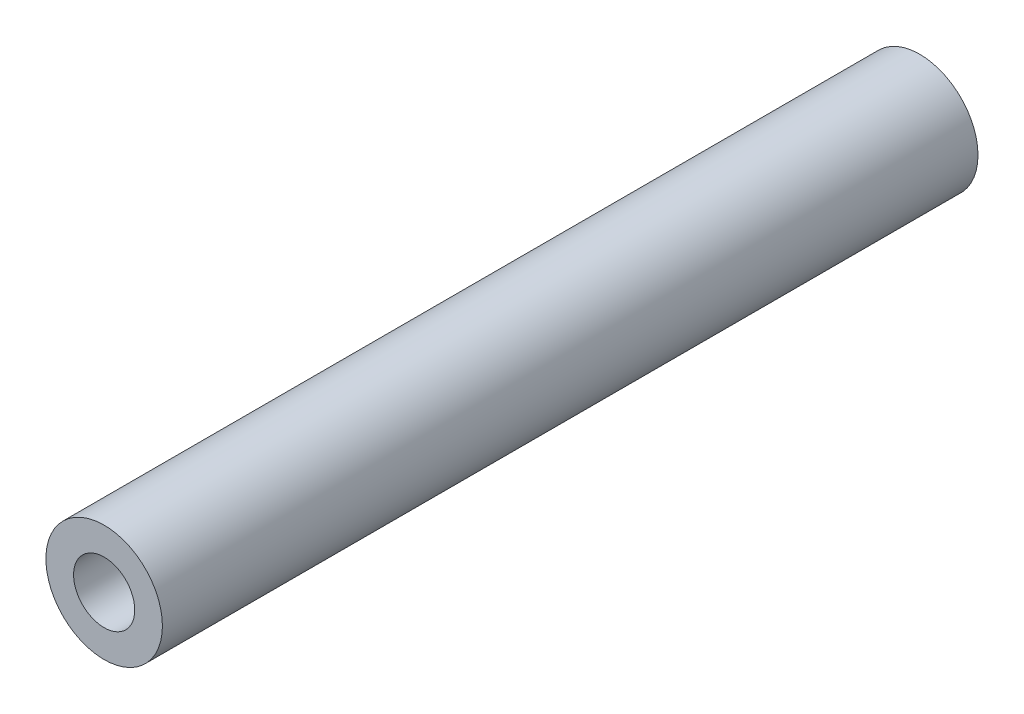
ISO-10303-21;
HEADER;
FILE_DESCRIPTION(('STEP AP214'),'2;1');
FILE_NAME('part.step','',(''),(''),'','','');
FILE_SCHEMA(('AUTOMOTIVE_DESIGN { 1 0 10303 214 1 1 1 1 }'));
ENDSEC;
DATA;
#1=APPLICATION_CONTEXT('core data for automotive mechanical design processes');
#2=APPLICATION_PROTOCOL_DEFINITION('international standard','automotive_design',2000,#1);
#3=PRODUCT_CONTEXT('',#1,'mechanical');
#4=PRODUCT('Part','Part','',(#3));
#5=PRODUCT_RELATED_PRODUCT_CATEGORY('part','',(#4));
#6=PRODUCT_DEFINITION_FORMATION('','',#4);
#7=PRODUCT_DEFINITION_CONTEXT('part definition',#1,'design');
#8=PRODUCT_DEFINITION('design','',#6,#7);
#9=PRODUCT_DEFINITION_SHAPE('','',#8);
#10=(LENGTH_UNIT() NAMED_UNIT(*) SI_UNIT(.MILLI.,.METRE.));
#11=(NAMED_UNIT(*) PLANE_ANGLE_UNIT() SI_UNIT($,.RADIAN.));
#12=(NAMED_UNIT(*) SI_UNIT($,.STERADIAN.) SOLID_ANGLE_UNIT());
#13=UNCERTAINTY_MEASURE_WITH_UNIT(LENGTH_MEASURE(1.E-05),#10,'distance_accuracy_value','');
#14=(GEOMETRIC_REPRESENTATION_CONTEXT(3) GLOBAL_UNCERTAINTY_ASSIGNED_CONTEXT((#13)) GLOBAL_UNIT_ASSIGNED_CONTEXT((#10,
#11,#12)) REPRESENTATION_CONTEXT('',''));
#15=CARTESIAN_POINT('',(0.,0.,0.));
#16=DIRECTION('',(0.,0.,1.));
#17=DIRECTION('',(1.,0.,0.));
#18=AXIS2_PLACEMENT_3D('',#15,#16,#17);
#19=CARTESIAN_POINT('',(-10.5000000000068,-73.3968532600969,56.));
#20=DIRECTION('',(0.,0.,-1.));
#21=DIRECTION('',(-1.,0.,0.));
#22=AXIS2_PLACEMENT_3D('',#19,#20,#21);
#23=CYLINDRICAL_SURFACE('',#22,4.);
#24=CARTESIAN_POINT('',(-10.5000000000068,-73.3968532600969,56.));
#25=DIRECTION('',(0.,0.,1.));
#26=DIRECTION('',(1.,0.,0.));
#27=AXIS2_PLACEMENT_3D('',#24,#25,#26);
#28=CIRCLE('',#27,4.);
#29=CARTESIAN_POINT('',(-6.50000000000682,-73.3968532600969,56.));
#30=VERTEX_POINT('',#29);
#31=EDGE_CURVE('E11',#30,#30,#28,.T.);
#32=ORIENTED_EDGE('',*,*,#31,.F.);
#33=EDGE_LOOP('',(#32));
#34=FACE_BOUND('',#33,.T.);
#35=CARTESIAN_POINT('',(-10.5000000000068,-73.3968532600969,0.));
#36=DIRECTION('',(0.,0.,1.));
#37=DIRECTION('',(1.,0.,0.));
#38=AXIS2_PLACEMENT_3D('',#35,#36,#37);
#39=CIRCLE('',#38,4.);
#40=CARTESIAN_POINT('',(-6.50000000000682,-73.3968532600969,0.));
#41=VERTEX_POINT('',#40);
#42=EDGE_CURVE('E19',#41,#41,#39,.T.);
#43=ORIENTED_EDGE('',*,*,#42,.T.);
#44=EDGE_LOOP('',(#43));
#45=FACE_BOUND('',#44,.T.);
#46=ADVANCED_FACE('F16',(#34,#45),#23,.T.);
#47=CARTESIAN_POINT('',(-10.5000000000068,-73.3968532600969,56.));
#48=DIRECTION('',(0.,0.,1.));
#49=DIRECTION('',(1.,0.,0.));
#50=AXIS2_PLACEMENT_3D('',#47,#48,#49);
#51=PLANE('',#50);
#52=CARTESIAN_POINT('',(-10.5000000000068,-73.3968532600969,56.));
#53=DIRECTION('',(0.,0.,1.));
#54=DIRECTION('',(1.,0.,0.));
#55=AXIS2_PLACEMENT_3D('',#52,#53,#54);
#56=CIRCLE('',#55,2.1);
#57=CARTESIAN_POINT('',(-8.40000000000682,-73.3968532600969,56.));
#58=VERTEX_POINT('',#57);
#59=EDGE_CURVE('E40',#58,#58,#56,.T.);
#60=ORIENTED_EDGE('',*,*,#59,.F.);
#61=EDGE_LOOP('',(#60));
#62=FACE_BOUND('',#61,.T.);
#63=ORIENTED_EDGE('',*,*,#31,.T.);
#64=EDGE_LOOP('',(#63));
#65=FACE_BOUND('',#64,.T.);
#66=ADVANCED_FACE('F58',(#62,#65),#51,.T.);
#67=CARTESIAN_POINT('',(-10.5000000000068,-73.3968532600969,0.));
#68=DIRECTION('',(0.,0.,1.));
#69=DIRECTION('',(1.,0.,0.));
#70=AXIS2_PLACEMENT_3D('',#67,#68,#69);
#71=PLANE('',#70);
#72=CARTESIAN_POINT('',(-10.5000000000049,-73.3968532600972,0.));
#73=DIRECTION('',(0.,0.,-1.));
#74=DIRECTION('',(-1.,0.,0.));
#75=AXIS2_PLACEMENT_3D('',#72,#73,#74);
#76=CIRCLE('',#75,2.1);
#77=CARTESIAN_POINT('',(-12.6000000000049,-73.3968532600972,0.));
#78=VERTEX_POINT('',#77);
#79=EDGE_CURVE('E39',#78,#78,#76,.T.);
#80=ORIENTED_EDGE('',*,*,#79,.F.);
#81=EDGE_LOOP('',(#80));
#82=FACE_BOUND('',#81,.T.);
#83=ORIENTED_EDGE('',*,*,#42,.F.);
#84=EDGE_LOOP('',(#83));
#85=FACE_BOUND('',#84,.T.);
#86=ADVANCED_FACE('F55',(#82,#85),#71,.F.);
#87=CARTESIAN_POINT('',(-10.5000000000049,-73.3968532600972,14.4));
#88=DIRECTION('',(0.,0.,-1.));
#89=DIRECTION('',(-1.,0.,0.));
#90=AXIS2_PLACEMENT_3D('',#87,#88,#89);
#91=CONICAL_SURFACE('',#90,2.1,1.02974425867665);
#92=CARTESIAN_POINT('',(-10.5000000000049,-73.3968532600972,15.6618072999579));
#93=VERTEX_POINT('',#92);
#94=VERTEX_LOOP('',#93);
#95=FACE_BOUND('',#94,.T.);
#96=CARTESIAN_POINT('',(-10.5000000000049,-73.3968532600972,14.4));
#97=DIRECTION('',(0.,0.,-1.));
#98=DIRECTION('',(-1.,0.,0.));
#99=AXIS2_PLACEMENT_3D('',#96,#97,#98);
#100=CIRCLE('',#99,2.1);
#101=CARTESIAN_POINT('',(-12.6000000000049,-73.3968532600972,14.4));
#102=VERTEX_POINT('',#101);
#103=EDGE_CURVE('E43',#102,#102,#100,.T.);
#104=ORIENTED_EDGE('',*,*,#103,.T.);
#105=EDGE_LOOP('',(#104));
#106=FACE_BOUND('',#105,.T.);
#107=ADVANCED_FACE('F57',(#95,#106),#91,.F.);
#108=CARTESIAN_POINT('',(-10.5000000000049,-73.3968532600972,0.));
#109=DIRECTION('',(0.,0.,-1.));
#110=DIRECTION('',(-1.,0.,0.));
#111=AXIS2_PLACEMENT_3D('',#108,#109,#110);
#112=CYLINDRICAL_SURFACE('',#111,2.1);
#113=ORIENTED_EDGE('',*,*,#103,.F.);
#114=EDGE_LOOP('',(#113));
#115=FACE_BOUND('',#114,.T.);
#116=ORIENTED_EDGE('',*,*,#79,.T.);
#117=EDGE_LOOP('',(#116));
#118=FACE_BOUND('',#117,.T.);
#119=ADVANCED_FACE('F33',(#115,#118),#112,.F.);
#120=CARTESIAN_POINT('',(-10.5000000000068,-73.3968532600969,41.6));
#121=DIRECTION('',(0.,0.,1.));
#122=DIRECTION('',(1.,0.,0.));
#123=AXIS2_PLACEMENT_3D('',#120,#121,#122);
#124=CONICAL_SURFACE('',#123,2.1,1.02974425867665);
#125=CARTESIAN_POINT('',(-10.5000000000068,-73.3968532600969,40.3381927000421));
#126=VERTEX_POINT('',#125);
#127=VERTEX_LOOP('',#126);
#128=FACE_BOUND('',#127,.T.);
#129=CARTESIAN_POINT('',(-10.5000000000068,-73.3968532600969,41.6));
#130=DIRECTION('',(0.,0.,1.));
#131=DIRECTION('',(1.,0.,0.));
#132=AXIS2_PLACEMENT_3D('',#129,#130,#131);
#133=CIRCLE('',#132,2.1);
#134=CARTESIAN_POINT('',(-8.40000000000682,-73.3968532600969,41.6));
#135=VERTEX_POINT('',#134);
#136=EDGE_CURVE('E37',#135,#135,#133,.T.);
#137=ORIENTED_EDGE('',*,*,#136,.T.);
#138=EDGE_LOOP('',(#137));
#139=FACE_BOUND('',#138,.T.);
#140=ADVANCED_FACE('F29',(#128,#139),#124,.F.);
#141=CARTESIAN_POINT('',(-10.5000000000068,-73.3968532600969,56.));
#142=DIRECTION('',(0.,0.,1.));
#143=DIRECTION('',(1.,0.,0.));
#144=AXIS2_PLACEMENT_3D('',#141,#142,#143);
#145=CYLINDRICAL_SURFACE('',#144,2.1);
#146=ORIENTED_EDGE('',*,*,#136,.F.);
#147=EDGE_LOOP('',(#146));
#148=FACE_BOUND('',#147,.T.);
#149=ORIENTED_EDGE('',*,*,#59,.T.);
#150=EDGE_LOOP('',(#149));
#151=FACE_BOUND('',#150,.T.);
#152=ADVANCED_FACE('F32',(#148,#151),#145,.F.);
#153=CLOSED_SHELL('',(#46,#66,#86,#107,#119,#140,#152));
#154=MANIFOLD_SOLID_BREP('B1',#153);
#155=ADVANCED_BREP_SHAPE_REPRESENTATION('',(#18,#154),#14);
#156=SHAPE_DEFINITION_REPRESENTATION(#9,#155);
ENDSEC;
END-ISO-10303-21;
